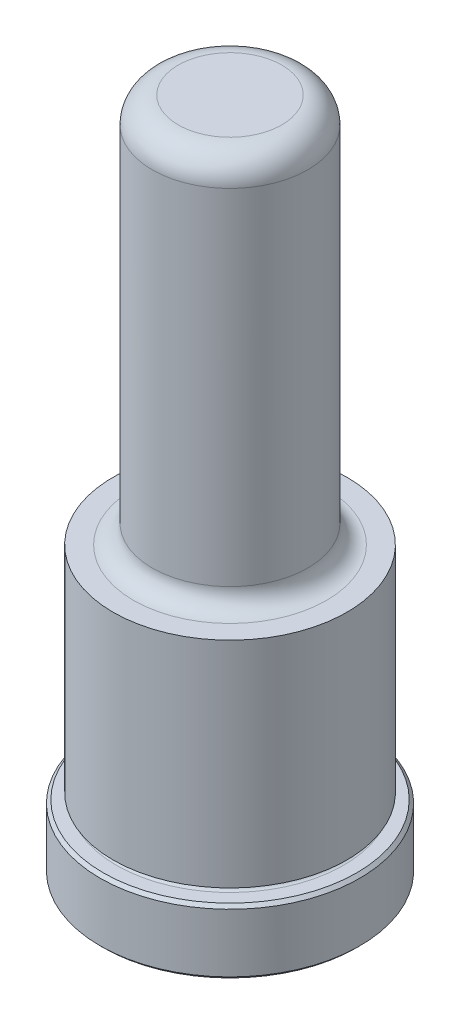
ISO-10303-21;
HEADER;
FILE_DESCRIPTION(('STEP AP214'),'2;1');
FILE_NAME('part.step','',(''),(''),'','','');
FILE_SCHEMA(('AUTOMOTIVE_DESIGN { 1 0 10303 214 1 1 1 1 }'));
ENDSEC;
DATA;
#1=APPLICATION_CONTEXT('core data for automotive mechanical design processes');
#2=APPLICATION_PROTOCOL_DEFINITION('international standard','automotive_design',2000,#1);
#3=PRODUCT_CONTEXT('',#1,'mechanical');
#4=PRODUCT('Part','Part','',(#3));
#5=PRODUCT_RELATED_PRODUCT_CATEGORY('part','',(#4));
#6=PRODUCT_DEFINITION_FORMATION('','',#4);
#7=PRODUCT_DEFINITION_CONTEXT('part definition',#1,'design');
#8=PRODUCT_DEFINITION('design','',#6,#7);
#9=PRODUCT_DEFINITION_SHAPE('','',#8);
#10=(LENGTH_UNIT() NAMED_UNIT(*) SI_UNIT(.MILLI.,.METRE.));
#11=(NAMED_UNIT(*) PLANE_ANGLE_UNIT() SI_UNIT($,.RADIAN.));
#12=(NAMED_UNIT(*) SI_UNIT($,.STERADIAN.) SOLID_ANGLE_UNIT());
#13=UNCERTAINTY_MEASURE_WITH_UNIT(LENGTH_MEASURE(1.E-05),#10,'distance_accuracy_value','');
#14=(GEOMETRIC_REPRESENTATION_CONTEXT(3) GLOBAL_UNCERTAINTY_ASSIGNED_CONTEXT((#13)) GLOBAL_UNIT_ASSIGNED_CONTEXT((#10,
#11,#12)) REPRESENTATION_CONTEXT('',''));
#15=CARTESIAN_POINT('',(0.,0.,0.));
#16=DIRECTION('',(0.,0.,1.));
#17=DIRECTION('',(1.,0.,0.));
#18=AXIS2_PLACEMENT_3D('',#15,#16,#17);
#19=CARTESIAN_POINT('',(0.,0.,0.));
#20=DIRECTION('',(0.,1.,0.));
#21=DIRECTION('',(0.,0.,1.));
#22=AXIS2_PLACEMENT_3D('',#19,#20,#21);
#23=PLANE('',#22);
#24=CARTESIAN_POINT('',(0.,0.,0.));
#25=DIRECTION('',(0.,1.,0.));
#26=DIRECTION('',(0.,0.,1.));
#27=AXIS2_PLACEMENT_3D('',#24,#25,#26);
#28=CIRCLE('',#27,15.494);
#29=CARTESIAN_POINT('',(0.,0.,15.494));
#30=VERTEX_POINT('',#29);
#31=EDGE_CURVE('E46',#30,#30,#28,.F.);
#32=ORIENTED_EDGE('',*,*,#31,.T.);
#33=EDGE_LOOP('',(#32));
#34=FACE_BOUND('',#33,.T.);
#35=ADVANCED_FACE('F31',(#34),#23,.F.);
#36=CARTESIAN_POINT('',(0.,0.,0.));
#37=DIRECTION('',(0.,1.,0.));
#38=DIRECTION('',(0.,0.,1.));
#39=AXIS2_PLACEMENT_3D('',#36,#37,#38);
#40=CYLINDRICAL_SURFACE('',#39,15.875);
#41=CARTESIAN_POINT('',(0.,0.380999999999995,0.));
#42=DIRECTION('',(0.,1.,0.));
#43=DIRECTION('',(0.,0.,1.));
#44=AXIS2_PLACEMENT_3D('',#41,#42,#43);
#45=CIRCLE('',#44,15.875);
#46=CARTESIAN_POINT('',(0.,0.380999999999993,15.875));
#47=VERTEX_POINT('',#46);
#48=EDGE_CURVE('E51',#47,#47,#45,.T.);
#49=ORIENTED_EDGE('',*,*,#48,.T.);
#50=EDGE_LOOP('',(#49));
#51=FACE_BOUND('',#50,.T.);
#52=CARTESIAN_POINT('',(0.,7.5438,0.));
#53=DIRECTION('',(0.,-1.,0.));
#54=DIRECTION('',(0.,0.,-1.));
#55=AXIS2_PLACEMENT_3D('',#52,#53,#54);
#56=CIRCLE('',#55,15.875);
#57=CARTESIAN_POINT('',(0.,7.5438,-15.875));
#58=VERTEX_POINT('',#57);
#59=EDGE_CURVE('E54',#58,#58,#56,.T.);
#60=ORIENTED_EDGE('',*,*,#59,.T.);
#61=EDGE_LOOP('',(#60));
#62=FACE_BOUND('',#61,.T.);
#63=ADVANCED_FACE('F110',(#51,#62),#40,.T.);
#64=CARTESIAN_POINT('',(0.,7.9248,-15.875));
#65=DIRECTION('',(0.,-1.,0.));
#66=DIRECTION('',(0.,0.,-1.));
#67=AXIS2_PLACEMENT_3D('',#64,#65,#66);
#68=PLANE('',#67);
#69=CARTESIAN_POINT('',(0.,7.9248,0.));
#70=DIRECTION('',(0.,-1.,0.));
#71=DIRECTION('',(0.,0.,-1.));
#72=AXIS2_PLACEMENT_3D('',#69,#70,#71);
#73=CIRCLE('',#72,15.494);
#74=CARTESIAN_POINT('',(0.,7.9248,-15.494));
#75=VERTEX_POINT('',#74);
#76=EDGE_CURVE('E42',#75,#75,#73,.F.);
#77=ORIENTED_EDGE('',*,*,#76,.T.);
#78=EDGE_LOOP('',(#77));
#79=FACE_BOUND('',#78,.T.);
#80=CARTESIAN_POINT('',(0.,7.9248,0.));
#81=DIRECTION('',(0.,1.,0.));
#82=DIRECTION('',(0.,0.,1.));
#83=AXIS2_PLACEMENT_3D('',#80,#81,#82);
#84=CIRCLE('',#83,13.8938);
#85=CARTESIAN_POINT('',(0.,7.9248,13.8938));
#86=VERTEX_POINT('',#85);
#87=EDGE_CURVE('E57',#86,#86,#84,.T.);
#88=ORIENTED_EDGE('',*,*,#87,.F.);
#89=EDGE_LOOP('',(#88));
#90=FACE_BOUND('',#89,.T.);
#91=ADVANCED_FACE('F105',(#79,#90),#68,.F.);
#92=CARTESIAN_POINT('',(0.,8.3058,0.));
#93=DIRECTION('',(0.,1.,0.));
#94=DIRECTION('',(0.,0.,1.));
#95=AXIS2_PLACEMENT_3D('',#92,#93,#94);
#96=TOROIDAL_SURFACE('',#95,13.8938,0.381000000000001);
#97=CARTESIAN_POINT('',(0.,8.68680000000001,0.));
#98=DIRECTION('',(0.,1.,0.));
#99=DIRECTION('',(0.,0.,1.));
#100=AXIS2_PLACEMENT_3D('',#97,#98,#99);
#101=CIRCLE('',#100,13.8938);
#102=CARTESIAN_POINT('',(0.,8.6868,13.8938));
#103=VERTEX_POINT('',#102);
#104=EDGE_CURVE('E60',#103,#103,#101,.T.);
#105=ORIENTED_EDGE('',*,*,#104,.F.);
#106=EDGE_LOOP('',(#105));
#107=FACE_BOUND('',#106,.T.);
#108=ORIENTED_EDGE('',*,*,#87,.T.);
#109=EDGE_LOOP('',(#108));
#110=FACE_BOUND('',#109,.T.);
#111=ADVANCED_FACE('F99',(#107,#110),#96,.F.);
#112=CARTESIAN_POINT('',(0.,8.68680000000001,-13.8938));
#113=DIRECTION('',(0.,1.,0.));
#114=DIRECTION('',(0.,0.,1.));
#115=AXIS2_PLACEMENT_3D('',#112,#113,#114);
#116=PLANE('',#115);
#117=CARTESIAN_POINT('',(0.,8.6868,0.));
#118=DIRECTION('',(0.,1.,0.));
#119=DIRECTION('',(0.,0.,1.));
#120=AXIS2_PLACEMENT_3D('',#117,#118,#119);
#121=CIRCLE('',#120,14.3002);
#122=CARTESIAN_POINT('',(0.,8.6868,14.3002));
#123=VERTEX_POINT('',#122);
#124=EDGE_CURVE('E63',#123,#123,#121,.T.);
#125=ORIENTED_EDGE('',*,*,#124,.F.);
#126=EDGE_LOOP('',(#125));
#127=FACE_BOUND('',#126,.T.);
#128=ORIENTED_EDGE('',*,*,#104,.T.);
#129=EDGE_LOOP('',(#128));
#130=FACE_BOUND('',#129,.T.);
#131=ADVANCED_FACE('F93',(#127,#130),#116,.F.);
#132=CARTESIAN_POINT('',(0.,0.,0.));
#133=DIRECTION('',(0.,1.,0.));
#134=DIRECTION('',(0.,0.,1.));
#135=AXIS2_PLACEMENT_3D('',#132,#133,#134);
#136=CYLINDRICAL_SURFACE('',#135,14.3002);
#137=CARTESIAN_POINT('',(0.,34.925,0.));
#138=DIRECTION('',(0.,1.,0.));
#139=DIRECTION('',(0.,0.,1.));
#140=AXIS2_PLACEMENT_3D('',#137,#138,#139);
#141=CIRCLE('',#140,14.3002);
#142=CARTESIAN_POINT('',(0.,34.925,14.3002));
#143=VERTEX_POINT('',#142);
#144=EDGE_CURVE('E66',#143,#143,#141,.T.);
#145=ORIENTED_EDGE('',*,*,#144,.F.);
#146=EDGE_LOOP('',(#145));
#147=FACE_BOUND('',#146,.T.);
#148=ORIENTED_EDGE('',*,*,#124,.T.);
#149=EDGE_LOOP('',(#148));
#150=FACE_BOUND('',#149,.T.);
#151=ADVANCED_FACE('F87',(#147,#150),#136,.T.);
#152=CARTESIAN_POINT('',(0.,34.925,-14.3002));
#153=DIRECTION('',(0.,-1.,0.));
#154=DIRECTION('',(0.,0.,-1.));
#155=AXIS2_PLACEMENT_3D('',#152,#153,#154);
#156=PLANE('',#155);
#157=CARTESIAN_POINT('',(0.,34.925,0.));
#158=DIRECTION('',(0.,1.,0.));
#159=DIRECTION('',(0.,0.,1.));
#160=AXIS2_PLACEMENT_3D('',#157,#158,#159);
#161=CIRCLE('',#160,11.7983);
#162=CARTESIAN_POINT('',(0.,34.925,11.7983));
#163=VERTEX_POINT('',#162);
#164=EDGE_CURVE('E69',#163,#163,#161,.T.);
#165=ORIENTED_EDGE('',*,*,#164,.F.);
#166=EDGE_LOOP('',(#165));
#167=FACE_BOUND('',#166,.T.);
#168=ORIENTED_EDGE('',*,*,#144,.T.);
#169=EDGE_LOOP('',(#168));
#170=FACE_BOUND('',#169,.T.);
#171=ADVANCED_FACE('F81',(#167,#170),#156,.F.);
#172=CARTESIAN_POINT('',(0.,37.211,0.));
#173=DIRECTION('',(0.,1.,0.));
#174=DIRECTION('',(0.,0.,1.));
#175=AXIS2_PLACEMENT_3D('',#172,#173,#174);
#176=TOROIDAL_SURFACE('',#175,11.7983,2.28599999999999);
#177=CARTESIAN_POINT('',(0.,37.211,0.));
#178=DIRECTION('',(0.,1.,0.));
#179=DIRECTION('',(0.,0.,1.));
#180=AXIS2_PLACEMENT_3D('',#177,#178,#179);
#181=CIRCLE('',#180,9.51230000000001);
#182=CARTESIAN_POINT('',(0.,37.211,9.51230000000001));
#183=VERTEX_POINT('',#182);
#184=EDGE_CURVE('E72',#183,#183,#181,.T.);
#185=ORIENTED_EDGE('',*,*,#184,.F.);
#186=EDGE_LOOP('',(#185));
#187=FACE_BOUND('',#186,.T.);
#188=ORIENTED_EDGE('',*,*,#164,.T.);
#189=EDGE_LOOP('',(#188));
#190=FACE_BOUND('',#189,.T.);
#191=ADVANCED_FACE('F78',(#187,#190),#176,.F.);
#192=CARTESIAN_POINT('',(0.,0.,0.));
#193=DIRECTION('',(0.,1.,0.));
#194=DIRECTION('',(0.,0.,1.));
#195=AXIS2_PLACEMENT_3D('',#192,#193,#194);
#196=CYLINDRICAL_SURFACE('',#195,9.51230000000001);
#197=CARTESIAN_POINT('',(0.,79.375,0.));
#198=DIRECTION('',(0.,-1.,0.));
#199=DIRECTION('',(0.,0.,-1.));
#200=AXIS2_PLACEMENT_3D('',#197,#198,#199);
#201=CIRCLE('',#200,9.51230000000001);
#202=CARTESIAN_POINT('',(0.,79.375,-9.5123));
#203=VERTEX_POINT('',#202);
#204=EDGE_CURVE('E10',#203,#203,#201,.T.);
#205=ORIENTED_EDGE('',*,*,#204,.T.);
#206=EDGE_LOOP('',(#205));
#207=FACE_BOUND('',#206,.T.);
#208=ORIENTED_EDGE('',*,*,#184,.T.);
#209=EDGE_LOOP('',(#208));
#210=FACE_BOUND('',#209,.T.);
#211=ADVANCED_FACE('F76',(#207,#210),#196,.T.);
#212=CARTESIAN_POINT('',(0.,82.55,-9.51229999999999));
#213=DIRECTION('',(0.,-1.,0.));
#214=DIRECTION('',(0.,0.,-1.));
#215=AXIS2_PLACEMENT_3D('',#212,#213,#214);
#216=PLANE('',#215);
#217=CARTESIAN_POINT('',(0.,82.55,0.));
#218=DIRECTION('',(0.,-1.,0.));
#219=DIRECTION('',(0.,0.,-1.));
#220=AXIS2_PLACEMENT_3D('',#217,#218,#219);
#221=CIRCLE('',#220,6.33730000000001);
#222=CARTESIAN_POINT('',(0.,82.55,-6.3373));
#223=VERTEX_POINT('',#222);
#224=EDGE_CURVE('E38',#223,#223,#221,.F.);
#225=ORIENTED_EDGE('',*,*,#224,.T.);
#226=EDGE_LOOP('',(#225));
#227=FACE_BOUND('',#226,.T.);
#228=ADVANCED_FACE('F127',(#227),#216,.F.);
#229=CARTESIAN_POINT('',(0.,0.380999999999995,0.));
#230=DIRECTION('',(0.,1.,0.));
#231=DIRECTION('',(0.,0.,1.));
#232=AXIS2_PLACEMENT_3D('',#229,#230,#231);
#233=CONICAL_SURFACE('',#232,15.875,0.785398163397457);
#234=ORIENTED_EDGE('',*,*,#31,.F.);
#235=EDGE_LOOP('',(#234));
#236=FACE_BOUND('',#235,.T.);
#237=ORIENTED_EDGE('',*,*,#48,.F.);
#238=EDGE_LOOP('',(#237));
#239=FACE_BOUND('',#238,.T.);
#240=ADVANCED_FACE('F124',(#236,#239),#233,.T.);
#241=CARTESIAN_POINT('',(0.,7.9248,0.));
#242=DIRECTION('',(0.,-1.,0.));
#243=DIRECTION('',(0.,0.,-1.));
#244=AXIS2_PLACEMENT_3D('',#241,#242,#243);
#245=CONICAL_SURFACE('',#244,15.494,0.78539816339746);
#246=ORIENTED_EDGE('',*,*,#59,.F.);
#247=EDGE_LOOP('',(#246));
#248=FACE_BOUND('',#247,.T.);
#249=ORIENTED_EDGE('',*,*,#76,.F.);
#250=EDGE_LOOP('',(#249));
#251=FACE_BOUND('',#250,.T.);
#252=ADVANCED_FACE('F126',(#248,#251),#245,.T.);
#253=CARTESIAN_POINT('',(0.,79.375,0.));
#254=DIRECTION('',(0.,-1.,0.));
#255=DIRECTION('',(0.,0.,-1.));
#256=AXIS2_PLACEMENT_3D('',#253,#254,#255);
#257=TOROIDAL_SURFACE('',#256,6.33730000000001,3.175);
#258=ORIENTED_EDGE('',*,*,#204,.F.);
#259=EDGE_LOOP('',(#258));
#260=FACE_BOUND('',#259,.T.);
#261=ORIENTED_EDGE('',*,*,#224,.F.);
#262=EDGE_LOOP('',(#261));
#263=FACE_BOUND('',#262,.T.);
#264=ADVANCED_FACE('F33',(#260,#263),#257,.T.);
#265=CLOSED_SHELL('',(#35,#63,#91,#111,#131,#151,#171,#191,#211,#228,#240,#252,#264));
#266=MANIFOLD_SOLID_BREP('B2',#265);
#267=ADVANCED_BREP_SHAPE_REPRESENTATION('',(#18,#266),#14);
#268=SHAPE_DEFINITION_REPRESENTATION(#9,#267);
ENDSEC;
END-ISO-10303-21;
